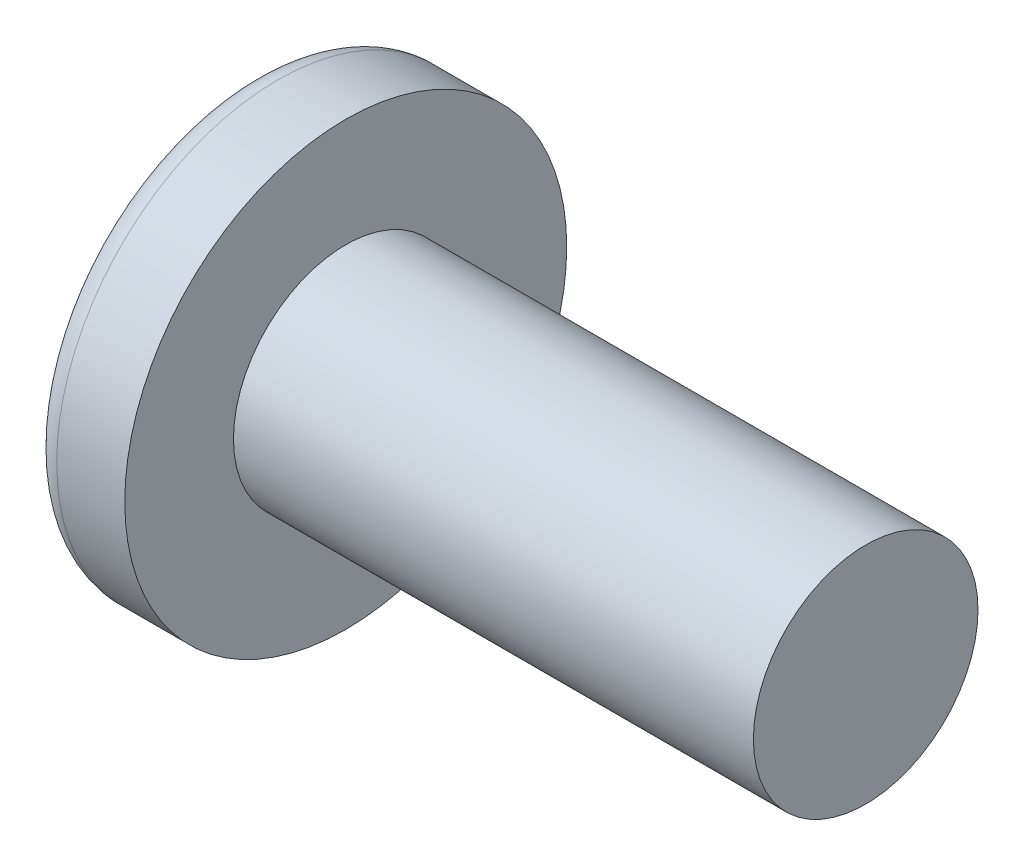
ISO-10303-21;
HEADER;
FILE_DESCRIPTION(('STEP AP214'),'2;1');
FILE_NAME('part.step','',(''),(''),'','','');
FILE_SCHEMA(('AUTOMOTIVE_DESIGN { 1 0 10303 214 1 1 1 1 }'));
ENDSEC;
DATA;
#1=APPLICATION_CONTEXT('core data for automotive mechanical design processes');
#2=APPLICATION_PROTOCOL_DEFINITION('international standard','automotive_design',2000,#1);
#3=PRODUCT_CONTEXT('',#1,'mechanical');
#4=PRODUCT('Part','Part','',(#3));
#5=PRODUCT_RELATED_PRODUCT_CATEGORY('part','',(#4));
#6=PRODUCT_DEFINITION_FORMATION('','',#4);
#7=PRODUCT_DEFINITION_CONTEXT('part definition',#1,'design');
#8=PRODUCT_DEFINITION('design','',#6,#7);
#9=PRODUCT_DEFINITION_SHAPE('','',#8);
#10=(LENGTH_UNIT() NAMED_UNIT(*) SI_UNIT(.MILLI.,.METRE.));
#11=(NAMED_UNIT(*) PLANE_ANGLE_UNIT() SI_UNIT($,.RADIAN.));
#12=(NAMED_UNIT(*) SI_UNIT($,.STERADIAN.) SOLID_ANGLE_UNIT());
#13=UNCERTAINTY_MEASURE_WITH_UNIT(LENGTH_MEASURE(1.E-05),#10,'distance_accuracy_value','');
#14=(GEOMETRIC_REPRESENTATION_CONTEXT(3) GLOBAL_UNCERTAINTY_ASSIGNED_CONTEXT((#13)) GLOBAL_UNIT_ASSIGNED_CONTEXT((#10,
#11,#12)) REPRESENTATION_CONTEXT('',''));
#15=CARTESIAN_POINT('',(0.,0.,0.));
#16=DIRECTION('',(0.,0.,1.));
#17=DIRECTION('',(1.,0.,0.));
#18=AXIS2_PLACEMENT_3D('',#15,#16,#17);
#19=CARTESIAN_POINT('',(8.77824,0.,0.));
#20=DIRECTION('',(-1.,0.,0.));
#21=DIRECTION('',(0.,1.,0.));
#22=AXIS2_PLACEMENT_3D('',#19,#20,#21);
#23=SPHERICAL_SURFACE('',#22,8.77824);
#24=CARTESIAN_POINT('',(1.65778809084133,0.,0.));
#25=DIRECTION('',(-1.,0.,0.));
#26=DIRECTION('',(0.,0.,1.));
#27=AXIS2_PLACEMENT_3D('',#24,#25,#26);
#28=CIRCLE('',#27,5.13387398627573);
#29=CARTESIAN_POINT('',(1.65778809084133,0.,5.13387398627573));
#30=VERTEX_POINT('',#29);
#31=EDGE_CURVE('E153',#30,#30,#28,.T.);
#32=ORIENTED_EDGE('',*,*,#31,.T.);
#33=EDGE_LOOP('',(#32));
#34=FACE_BOUND('',#33,.T.);
#35=CARTESIAN_POINT('',(8.77337578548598,-0.0602781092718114,0.));
#36=DIRECTION('',(-0.0804347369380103,-0.996759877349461,0.));
#37=DIRECTION('',(0.996759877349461,-0.0804347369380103,0.));
#38=AXIS2_PLACEMENT_3D('',#35,#36,#37);
#39=CIRCLE('',#38,8.77803169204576);
#40=CARTESIAN_POINT('',(0.55767879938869,0.602697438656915,3.01937524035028));
#41=VERTEX_POINT('',#40);
#42=CARTESIAN_POINT('',(0.0473558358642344,0.643878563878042,0.643878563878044));
#43=VERTEX_POINT('',#42);
#44=EDGE_CURVE('E184',#41,#43,#39,.T.);
#45=ORIENTED_EDGE('',*,*,#44,.F.);
#46=CARTESIAN_POINT('',(7.13266996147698,0.,-2.10953400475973));
#47=DIRECTION('',(0.615062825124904,0.,0.788478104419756));
#48=DIRECTION('',(0.788478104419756,0.,-0.615062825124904));
#49=AXIS2_PLACEMENT_3D('',#46,#47,#48);
#50=CIRCLE('',#49,8.36058987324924);
#51=CARTESIAN_POINT('',(0.55767879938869,-0.602697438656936,3.01937524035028));
#52=VERTEX_POINT('',#51);
#53=EDGE_CURVE('E149',#41,#52,#50,.T.);
#54=ORIENTED_EDGE('',*,*,#53,.T.);
#55=CARTESIAN_POINT('',(8.77337578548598,0.0602781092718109,0.));
#56=DIRECTION('',(-0.0804347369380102,0.996759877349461,0.));
#57=DIRECTION('',(-0.996759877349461,-0.0804347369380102,0.));
#58=AXIS2_PLACEMENT_3D('',#55,#56,#57);
#59=CIRCLE('',#58,8.77803169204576);
#60=CARTESIAN_POINT('',(0.0473558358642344,-0.643878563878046,0.643878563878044));
#61=VERTEX_POINT('',#60);
#62=EDGE_CURVE('E105',#61,#52,#59,.T.);
#63=ORIENTED_EDGE('',*,*,#62,.F.);
#64=CARTESIAN_POINT('',(8.77337578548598,0.,-0.0602781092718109));
#65=DIRECTION('',(-0.0804347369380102,0.,-0.996759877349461));
#66=DIRECTION('',(-0.996759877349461,0.,0.0804347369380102));
#67=AXIS2_PLACEMENT_3D('',#64,#65,#66);
#68=CIRCLE('',#67,8.77803169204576);
#69=CARTESIAN_POINT('',(0.55767879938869,-3.01937524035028,0.602697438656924));
#70=VERTEX_POINT('',#69);
#71=EDGE_CURVE('E130',#70,#61,#68,.T.);
#72=ORIENTED_EDGE('',*,*,#71,.F.);
#73=CARTESIAN_POINT('',(7.13266996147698,2.10953400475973,0.));
#74=DIRECTION('',(0.615062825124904,-0.788478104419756,0.));
#75=DIRECTION('',(0.788478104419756,0.615062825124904,0.));
#76=AXIS2_PLACEMENT_3D('',#73,#74,#75);
#77=CIRCLE('',#76,8.36058987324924);
#78=CARTESIAN_POINT('',(0.55767879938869,-3.01937524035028,-0.602697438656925));
#79=VERTEX_POINT('',#78);
#80=EDGE_CURVE('E138',#70,#79,#77,.T.);
#81=ORIENTED_EDGE('',*,*,#80,.T.);
#82=CARTESIAN_POINT('',(8.77337578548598,0.,0.0602781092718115));
#83=DIRECTION('',(-0.0804347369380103,0.,0.996759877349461));
#84=DIRECTION('',(0.996759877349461,0.,0.0804347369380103));
#85=AXIS2_PLACEMENT_3D('',#82,#83,#84);
#86=CIRCLE('',#85,8.77803169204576);
#87=CARTESIAN_POINT('',(0.0473558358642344,-0.643878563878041,-0.643878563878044));
#88=VERTEX_POINT('',#87);
#89=EDGE_CURVE('E48',#88,#79,#86,.T.);
#90=ORIENTED_EDGE('',*,*,#89,.F.);
#91=CARTESIAN_POINT('',(0.55767879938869,-0.602697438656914,-3.01937524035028));
#92=VERTEX_POINT('',#91);
#93=EDGE_CURVE('E191',#92,#88,#59,.T.);
#94=ORIENTED_EDGE('',*,*,#93,.F.);
#95=CARTESIAN_POINT('',(7.13266996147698,0.,2.10953400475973));
#96=DIRECTION('',(0.615062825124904,0.,-0.788478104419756));
#97=DIRECTION('',(-0.788478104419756,0.,-0.615062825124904));
#98=AXIS2_PLACEMENT_3D('',#95,#96,#97);
#99=CIRCLE('',#98,8.36058987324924);
#100=CARTESIAN_POINT('',(0.55767879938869,0.602697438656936,-3.01937524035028));
#101=VERTEX_POINT('',#100);
#102=EDGE_CURVE('E131',#92,#101,#99,.T.);
#103=ORIENTED_EDGE('',*,*,#102,.T.);
#104=CARTESIAN_POINT('',(0.0473558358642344,0.643878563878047,-0.643878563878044));
#105=VERTEX_POINT('',#104);
#106=EDGE_CURVE('E179',#105,#101,#39,.T.);
#107=ORIENTED_EDGE('',*,*,#106,.F.);
#108=CARTESIAN_POINT('',(0.55767879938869,3.01937524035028,-0.602697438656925));
#109=VERTEX_POINT('',#108);
#110=EDGE_CURVE('E41',#109,#105,#86,.T.);
#111=ORIENTED_EDGE('',*,*,#110,.F.);
#112=CARTESIAN_POINT('',(7.13266996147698,-2.10953400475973,0.));
#113=DIRECTION('',(0.615062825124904,0.788478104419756,0.));
#114=DIRECTION('',(-0.788478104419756,0.615062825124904,0.));
#115=AXIS2_PLACEMENT_3D('',#112,#113,#114);
#116=CIRCLE('',#115,8.36058987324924);
#117=CARTESIAN_POINT('',(0.55767879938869,3.01937524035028,0.602697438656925));
#118=VERTEX_POINT('',#117);
#119=EDGE_CURVE('E11',#109,#118,#116,.T.);
#120=ORIENTED_EDGE('',*,*,#119,.T.);
#121=EDGE_CURVE('E167',#43,#118,#68,.T.);
#122=ORIENTED_EDGE('',*,*,#121,.F.);
#123=EDGE_LOOP('',(#45,#54,#63,#72,#81,#90,#94,#103,#107,#111,#120,#122));
#124=FACE_BOUND('',#123,.T.);
#125=ADVANCED_FACE('F33',(#34,#124),#23,.T.);
#126=CARTESIAN_POINT('',(4.42835862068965,0.,-0.290348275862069));
#127=DIRECTION('',(-0.0804347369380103,0.,0.996759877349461));
#128=DIRECTION('',(0.996759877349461,0.,0.0804347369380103));
#129=AXIS2_PLACEMENT_3D('',#126,#127,#128);
#130=PLANE('',#129);
#131=ORIENTED_EDGE('',*,*,#110,.T.);
#132=DIRECTION('',(0.993551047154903,-0.0801757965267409,0.0801757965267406));
#133=VECTOR('',#132,1.);
#134=CARTESIAN_POINT('',(4.45148740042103,0.288481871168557,-0.288481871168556));
#135=LINE('',#134,#133);
#136=CARTESIAN_POINT('',(4.0132,0.323850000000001,-0.323849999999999));
#137=VERTEX_POINT('',#136);
#138=EDGE_CURVE('E173',#105,#137,#135,.T.);
#139=ORIENTED_EDGE('',*,*,#138,.T.);
#140=DIRECTION('',(0.786886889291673,-0.613821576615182,0.0634987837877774));
#141=VECTOR('',#140,1.);
#142=CARTESIAN_POINT('',(0.,3.4544,-0.6477));
#143=LINE('',#142,#141);
#144=EDGE_CURVE('E154',#109,#137,#143,.T.);
#145=ORIENTED_EDGE('',*,*,#144,.F.);
#146=EDGE_LOOP('',(#131,#139,#145));
#147=FACE_BOUND('',#146,.T.);
#148=ADVANCED_FACE('F172',(#147),#130,.T.);
#149=DIRECTION('',(0.786886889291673,0.613821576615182,0.0634987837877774));
#150=VECTOR('',#149,1.);
#151=CARTESIAN_POINT('',(0.,-3.4544,-0.6477));
#152=LINE('',#151,#150);
#153=CARTESIAN_POINT('',(4.0132,-0.32385,-0.32385));
#154=VERTEX_POINT('',#153);
#155=EDGE_CURVE('E139',#79,#154,#152,.T.);
#156=ORIENTED_EDGE('',*,*,#155,.T.);
#157=DIRECTION('',(-0.993551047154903,-0.0801757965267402,-0.0801757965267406));
#158=VECTOR('',#157,1.);
#159=CARTESIAN_POINT('',(4.45148740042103,-0.288481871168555,-0.288481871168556));
#160=LINE('',#159,#158);
#161=EDGE_CURVE('E194',#154,#88,#160,.T.);
#162=ORIENTED_EDGE('',*,*,#161,.T.);
#163=ORIENTED_EDGE('',*,*,#89,.T.);
#164=EDGE_LOOP('',(#156,#162,#163));
#165=FACE_BOUND('',#164,.T.);
#166=ADVANCED_FACE('F209',(#165),#130,.T.);
#167=CARTESIAN_POINT('',(4.42835862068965,0.,0.290348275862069));
#168=DIRECTION('',(-0.0804347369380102,0.,-0.996759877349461));
#169=DIRECTION('',(-0.996759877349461,0.,0.0804347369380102));
#170=AXIS2_PLACEMENT_3D('',#167,#168,#169);
#171=PLANE('',#170);
#172=DIRECTION('',(0.786886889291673,-0.613821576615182,-0.0634987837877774));
#173=VECTOR('',#172,1.);
#174=CARTESIAN_POINT('',(0.,3.4544,0.6477));
#175=LINE('',#174,#173);
#176=CARTESIAN_POINT('',(4.0132,0.32385,0.32385));
#177=VERTEX_POINT('',#176);
#178=EDGE_CURVE('E210',#118,#177,#175,.T.);
#179=ORIENTED_EDGE('',*,*,#178,.T.);
#180=DIRECTION('',(-0.993551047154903,0.0801757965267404,0.0801757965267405));
#181=VECTOR('',#180,1.);
#182=CARTESIAN_POINT('',(4.45148740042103,0.288481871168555,0.288481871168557));
#183=LINE('',#182,#181);
#184=EDGE_CURVE('E188',#177,#43,#183,.T.);
#185=ORIENTED_EDGE('',*,*,#184,.T.);
#186=ORIENTED_EDGE('',*,*,#121,.T.);
#187=EDGE_LOOP('',(#179,#185,#186));
#188=FACE_BOUND('',#187,.T.);
#189=ADVANCED_FACE('F214',(#188),#171,.T.);
#190=ORIENTED_EDGE('',*,*,#71,.T.);
#191=DIRECTION('',(0.993551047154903,0.0801757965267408,-0.0801757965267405));
#192=VECTOR('',#191,1.);
#193=CARTESIAN_POINT('',(4.45148740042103,-0.288481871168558,0.288481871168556));
#194=LINE('',#193,#192);
#195=CARTESIAN_POINT('',(4.0132,-0.323850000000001,0.323849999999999));
#196=VERTEX_POINT('',#195);
#197=EDGE_CURVE('E103',#61,#196,#194,.T.);
#198=ORIENTED_EDGE('',*,*,#197,.T.);
#199=DIRECTION('',(0.786886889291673,0.613821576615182,-0.0634987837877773));
#200=VECTOR('',#199,1.);
#201=CARTESIAN_POINT('',(0.,-3.4544,0.647699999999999));
#202=LINE('',#201,#200);
#203=EDGE_CURVE('E128',#70,#196,#202,.T.);
#204=ORIENTED_EDGE('',*,*,#203,.F.);
#205=EDGE_LOOP('',(#190,#198,#204));
#206=FACE_BOUND('',#205,.T.);
#207=ADVANCED_FACE('F127',(#206),#171,.T.);
#208=CARTESIAN_POINT('',(-25.4,0.,0.));
#209=DIRECTION('',(-1.,0.,0.));
#210=DIRECTION('',(0.,0.,1.));
#211=AXIS2_PLACEMENT_3D('',#208,#209,#210);
#212=CYLINDRICAL_SURFACE('',#211,2.7432);
#213=CARTESIAN_POINT('',(16.5354,0.,0.));
#214=DIRECTION('',(-1.,0.,0.));
#215=DIRECTION('',(0.,0.,1.));
#216=AXIS2_PLACEMENT_3D('',#213,#214,#215);
#217=CIRCLE('',#216,2.7432);
#218=CARTESIAN_POINT('',(16.5354,0.,2.7432));
#219=VERTEX_POINT('',#218);
#220=EDGE_CURVE('E150',#219,#219,#217,.T.);
#221=ORIENTED_EDGE('',*,*,#220,.T.);
#222=EDGE_LOOP('',(#221));
#223=FACE_BOUND('',#222,.T.);
#224=CARTESIAN_POINT('',(3.8354,0.,0.));
#225=DIRECTION('',(-1.,0.,0.));
#226=DIRECTION('',(0.,0.,1.));
#227=AXIS2_PLACEMENT_3D('',#224,#225,#226);
#228=CIRCLE('',#227,2.7432);
#229=CARTESIAN_POINT('',(3.8354,0.,2.7432));
#230=VERTEX_POINT('',#229);
#231=EDGE_CURVE('E163',#230,#230,#228,.T.);
#232=ORIENTED_EDGE('',*,*,#231,.F.);
#233=EDGE_LOOP('',(#232));
#234=FACE_BOUND('',#233,.T.);
#235=ADVANCED_FACE('F35',(#223,#234),#212,.T.);
#236=CARTESIAN_POINT('',(3.8354,2.7432,0.));
#237=DIRECTION('',(-1.,0.,0.));
#238=DIRECTION('',(0.,0.,1.));
#239=AXIS2_PLACEMENT_3D('',#236,#237,#238);
#240=PLANE('',#239);
#241=CARTESIAN_POINT('',(3.8354,0.,0.));
#242=DIRECTION('',(-1.,0.,0.));
#243=DIRECTION('',(0.,0.,1.));
#244=AXIS2_PLACEMENT_3D('',#241,#242,#243);
#245=CIRCLE('',#244,5.3975);
#246=CARTESIAN_POINT('',(3.8354,0.,5.3975));
#247=VERTEX_POINT('',#246);
#248=EDGE_CURVE('E160',#247,#247,#245,.T.);
#249=ORIENTED_EDGE('',*,*,#248,.F.);
#250=EDGE_LOOP('',(#249));
#251=FACE_BOUND('',#250,.T.);
#252=ORIENTED_EDGE('',*,*,#231,.T.);
#253=EDGE_LOOP('',(#252));
#254=FACE_BOUND('',#253,.T.);
#255=ADVANCED_FACE('F242',(#251,#254),#240,.F.);
#256=CARTESIAN_POINT('',(-25.4,0.,0.));
#257=DIRECTION('',(-1.,0.,0.));
#258=DIRECTION('',(0.,0.,1.));
#259=AXIS2_PLACEMENT_3D('',#256,#257,#258);
#260=CYLINDRICAL_SURFACE('',#259,5.3975);
#261=ORIENTED_EDGE('',*,*,#248,.T.);
#262=EDGE_LOOP('',(#261));
#263=FACE_BOUND('',#262,.T.);
#264=CARTESIAN_POINT('',(2.17286707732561,0.,0.));
#265=DIRECTION('',(-1.,0.,0.));
#266=DIRECTION('',(0.,0.,1.));
#267=AXIS2_PLACEMENT_3D('',#264,#265,#266);
#268=CIRCLE('',#267,5.3975);
#269=CARTESIAN_POINT('',(2.17286707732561,0.,5.3975));
#270=VERTEX_POINT('',#269);
#271=EDGE_CURVE('E157',#270,#270,#268,.T.);
#272=ORIENTED_EDGE('',*,*,#271,.F.);
#273=EDGE_LOOP('',(#272));
#274=FACE_BOUND('',#273,.T.);
#275=ADVANCED_FACE('F239',(#263,#274),#260,.T.);
#276=CARTESIAN_POINT('',(2.17286707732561,0.,0.));
#277=DIRECTION('',(-1.,0.,0.));
#278=DIRECTION('',(0.,0.,1.));
#279=AXIS2_PLACEMENT_3D('',#276,#277,#278);
#280=TOROIDAL_SURFACE('',#279,4.7625,0.635);
#281=ORIENTED_EDGE('',*,*,#271,.T.);
#282=EDGE_LOOP('',(#281));
#283=FACE_BOUND('',#282,.T.);
#284=ORIENTED_EDGE('',*,*,#31,.F.);
#285=EDGE_LOOP('',(#284));
#286=FACE_BOUND('',#285,.T.);
#287=ADVANCED_FACE('F236',(#283,#286),#280,.T.);
#288=CARTESIAN_POINT('',(16.5354,2.7432,0.));
#289=DIRECTION('',(1.,0.,0.));
#290=DIRECTION('',(0.,0.,-1.));
#291=AXIS2_PLACEMENT_3D('',#288,#289,#290);
#292=PLANE('',#291);
#293=ORIENTED_EDGE('',*,*,#220,.F.);
#294=EDGE_LOOP('',(#293));
#295=FACE_BOUND('',#294,.T.);
#296=ADVANCED_FACE('F234',(#295),#292,.T.);
#297=CARTESIAN_POINT('',(4.0132,0.32385,0.32385));
#298=DIRECTION('',(0.615062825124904,0.788478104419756,0.));
#299=DIRECTION('',(-0.788478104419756,0.615062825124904,0.));
#300=AXIS2_PLACEMENT_3D('',#297,#298,#299);
#301=PLANE('',#300);
#302=ORIENTED_EDGE('',*,*,#144,.T.);
#303=DIRECTION('',(0.,0.,-1.));
#304=VECTOR('',#303,1.);
#305=CARTESIAN_POINT('',(4.0132,0.32385,0.32385));
#306=LINE('',#305,#304);
#307=EDGE_CURVE('E121',#177,#137,#306,.T.);
#308=ORIENTED_EDGE('',*,*,#307,.F.);
#309=ORIENTED_EDGE('',*,*,#178,.F.);
#310=ORIENTED_EDGE('',*,*,#119,.F.);
#311=EDGE_LOOP('',(#302,#308,#309,#310));
#312=FACE_BOUND('',#311,.T.);
#313=ADVANCED_FACE('F213',(#312),#301,.F.);
#314=CARTESIAN_POINT('',(4.0132,-0.32385,-0.32385));
#315=DIRECTION('',(0.615062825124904,-0.788478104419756,0.));
#316=DIRECTION('',(0.788478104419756,0.615062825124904,0.));
#317=AXIS2_PLACEMENT_3D('',#314,#315,#316);
#318=PLANE('',#317);
#319=ORIENTED_EDGE('',*,*,#203,.T.);
#320=DIRECTION('',(0.,0.,1.));
#321=VECTOR('',#320,1.);
#322=CARTESIAN_POINT('',(4.0132,-0.32385,-0.32385));
#323=LINE('',#322,#321);
#324=EDGE_CURVE('E120',#154,#196,#323,.T.);
#325=ORIENTED_EDGE('',*,*,#324,.F.);
#326=ORIENTED_EDGE('',*,*,#155,.F.);
#327=ORIENTED_EDGE('',*,*,#80,.F.);
#328=EDGE_LOOP('',(#319,#325,#326,#327));
#329=FACE_BOUND('',#328,.T.);
#330=ADVANCED_FACE('F135',(#329),#318,.F.);
#331=CARTESIAN_POINT('',(4.0132,0.32385,-0.32385));
#332=DIRECTION('',(-1.,0.,0.));
#333=DIRECTION('',(0.,0.,1.));
#334=AXIS2_PLACEMENT_3D('',#331,#332,#333);
#335=PLANE('',#334);
#336=DIRECTION('',(0.,1.,0.));
#337=VECTOR('',#336,1.);
#338=CARTESIAN_POINT('',(4.0132,-0.32385,-0.32385));
#339=LINE('',#338,#337);
#340=EDGE_CURVE('E143',#154,#137,#339,.T.);
#341=ORIENTED_EDGE('',*,*,#340,.F.);
#342=ORIENTED_EDGE('',*,*,#324,.T.);
#343=DIRECTION('',(0.,-1.,0.));
#344=VECTOR('',#343,1.);
#345=CARTESIAN_POINT('',(4.0132,0.32385,0.32385));
#346=LINE('',#345,#344);
#347=EDGE_CURVE('E112',#177,#196,#346,.T.);
#348=ORIENTED_EDGE('',*,*,#347,.F.);
#349=ORIENTED_EDGE('',*,*,#307,.T.);
#350=EDGE_LOOP('',(#341,#342,#348,#349));
#351=FACE_BOUND('',#350,.T.);
#352=ADVANCED_FACE('F141',(#351),#335,.T.);
#353=CARTESIAN_POINT('',(4.0132,0.323850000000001,-0.323849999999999));
#354=DIRECTION('',(0.615062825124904,0.,-0.788478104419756));
#355=DIRECTION('',(0.788478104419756,0.,0.615062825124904));
#356=AXIS2_PLACEMENT_3D('',#353,#354,#355);
#357=PLANE('',#356);
#358=DIRECTION('',(0.786886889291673,0.0634987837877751,0.613821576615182));
#359=VECTOR('',#358,1.);
#360=CARTESIAN_POINT('',(0.,-0.647699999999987,-3.4544));
#361=LINE('',#360,#359);
#362=EDGE_CURVE('E199',#92,#154,#361,.T.);
#363=ORIENTED_EDGE('',*,*,#362,.T.);
#364=ORIENTED_EDGE('',*,*,#340,.T.);
#365=DIRECTION('',(0.786886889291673,-0.0634987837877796,0.613821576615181));
#366=VECTOR('',#365,1.);
#367=CARTESIAN_POINT('',(0.,0.647700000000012,-3.4544));
#368=LINE('',#367,#366);
#369=EDGE_CURVE('E109',#101,#137,#368,.T.);
#370=ORIENTED_EDGE('',*,*,#369,.F.);
#371=ORIENTED_EDGE('',*,*,#102,.F.);
#372=EDGE_LOOP('',(#363,#364,#370,#371));
#373=FACE_BOUND('',#372,.T.);
#374=ADVANCED_FACE('F204',(#373),#357,.F.);
#375=CARTESIAN_POINT('',(4.42835862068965,-0.290348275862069,0.));
#376=DIRECTION('',(-0.0804347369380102,0.996759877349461,0.));
#377=DIRECTION('',(-0.996759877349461,-0.0804347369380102,0.));
#378=AXIS2_PLACEMENT_3D('',#375,#376,#377);
#379=PLANE('',#378);
#380=ORIENTED_EDGE('',*,*,#93,.T.);
#381=ORIENTED_EDGE('',*,*,#161,.F.);
#382=ORIENTED_EDGE('',*,*,#362,.F.);
#383=EDGE_LOOP('',(#380,#381,#382));
#384=FACE_BOUND('',#383,.T.);
#385=ADVANCED_FACE('F208',(#384),#379,.T.);
#386=CARTESIAN_POINT('',(4.42835862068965,0.290348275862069,0.));
#387=DIRECTION('',(-0.0804347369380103,-0.996759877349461,0.));
#388=DIRECTION('',(0.996759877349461,-0.0804347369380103,0.));
#389=AXIS2_PLACEMENT_3D('',#386,#387,#388);
#390=PLANE('',#389);
#391=ORIENTED_EDGE('',*,*,#106,.T.);
#392=ORIENTED_EDGE('',*,*,#369,.T.);
#393=ORIENTED_EDGE('',*,*,#138,.F.);
#394=EDGE_LOOP('',(#391,#392,#393));
#395=FACE_BOUND('',#394,.T.);
#396=ADVANCED_FACE('F202',(#395),#390,.T.);
#397=CARTESIAN_POINT('',(4.0132,-0.323850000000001,0.323849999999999));
#398=DIRECTION('',(0.615062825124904,0.,0.788478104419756));
#399=DIRECTION('',(-0.788478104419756,0.,0.615062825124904));
#400=AXIS2_PLACEMENT_3D('',#397,#398,#399);
#401=PLANE('',#400);
#402=DIRECTION('',(0.786886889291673,-0.0634987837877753,-0.613821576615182));
#403=VECTOR('',#402,1.);
#404=CARTESIAN_POINT('',(0.,0.647699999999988,3.4544));
#405=LINE('',#404,#403);
#406=EDGE_CURVE('E108',#41,#177,#405,.T.);
#407=ORIENTED_EDGE('',*,*,#406,.T.);
#408=ORIENTED_EDGE('',*,*,#347,.T.);
#409=DIRECTION('',(0.786886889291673,0.0634987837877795,-0.613821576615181));
#410=VECTOR('',#409,1.);
#411=CARTESIAN_POINT('',(0.,-0.647700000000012,3.4544));
#412=LINE('',#411,#410);
#413=EDGE_CURVE('E99',#52,#196,#412,.T.);
#414=ORIENTED_EDGE('',*,*,#413,.F.);
#415=ORIENTED_EDGE('',*,*,#53,.F.);
#416=EDGE_LOOP('',(#407,#408,#414,#415));
#417=FACE_BOUND('',#416,.T.);
#418=ADVANCED_FACE('F113',(#417),#401,.F.);
#419=ORIENTED_EDGE('',*,*,#44,.T.);
#420=ORIENTED_EDGE('',*,*,#184,.F.);
#421=ORIENTED_EDGE('',*,*,#406,.F.);
#422=EDGE_LOOP('',(#419,#420,#421));
#423=FACE_BOUND('',#422,.T.);
#424=ADVANCED_FACE('F215',(#423),#390,.T.);
#425=ORIENTED_EDGE('',*,*,#62,.T.);
#426=ORIENTED_EDGE('',*,*,#413,.T.);
#427=ORIENTED_EDGE('',*,*,#197,.F.);
#428=EDGE_LOOP('',(#425,#426,#427));
#429=FACE_BOUND('',#428,.T.);
#430=ADVANCED_FACE('F101',(#429),#379,.T.);
#431=CLOSED_SHELL('',(#125,#148,#166,#189,#207,#235,#255,#275,#287,#296,#313,#330,#352,#374,
#385,#396,#418,#424,#430));
#432=MANIFOLD_SOLID_BREP('B2',#431);
#433=ADVANCED_BREP_SHAPE_REPRESENTATION('',(#18,#432),#14);
#434=SHAPE_DEFINITION_REPRESENTATION(#9,#433);
ENDSEC;
END-ISO-10303-21;
